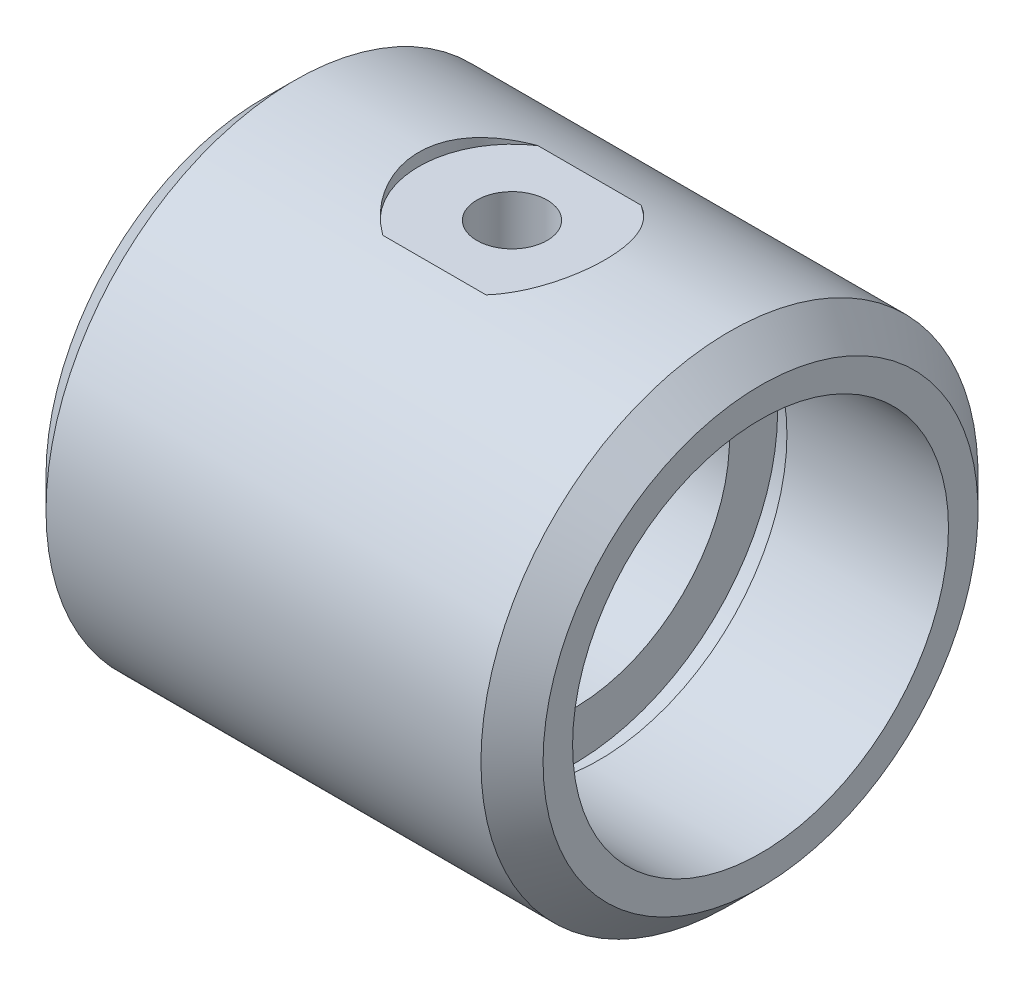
ISO-10303-21;
HEADER;
FILE_DESCRIPTION(('STEP AP214'),'2;1');
FILE_NAME('part.step','',(''),(''),'','','');
FILE_SCHEMA(('AUTOMOTIVE_DESIGN { 1 0 10303 214 1 1 1 1 }'));
ENDSEC;
DATA;
#1=APPLICATION_CONTEXT('core data for automotive mechanical design processes');
#2=APPLICATION_PROTOCOL_DEFINITION('international standard','automotive_design',2000,#1);
#3=PRODUCT_CONTEXT('',#1,'mechanical');
#4=PRODUCT('Part','Part','',(#3));
#5=PRODUCT_RELATED_PRODUCT_CATEGORY('part','',(#4));
#6=PRODUCT_DEFINITION_FORMATION('','',#4);
#7=PRODUCT_DEFINITION_CONTEXT('part definition',#1,'design');
#8=PRODUCT_DEFINITION('design','',#6,#7);
#9=PRODUCT_DEFINITION_SHAPE('','',#8);
#10=(LENGTH_UNIT() NAMED_UNIT(*) SI_UNIT(.MILLI.,.METRE.));
#11=(NAMED_UNIT(*) PLANE_ANGLE_UNIT() SI_UNIT($,.RADIAN.));
#12=(NAMED_UNIT(*) SI_UNIT($,.STERADIAN.) SOLID_ANGLE_UNIT());
#13=UNCERTAINTY_MEASURE_WITH_UNIT(LENGTH_MEASURE(1.E-05),#10,'distance_accuracy_value','');
#14=(GEOMETRIC_REPRESENTATION_CONTEXT(3) GLOBAL_UNCERTAINTY_ASSIGNED_CONTEXT((#13)) GLOBAL_UNIT_ASSIGNED_CONTEXT((#10,
#11,#12)) REPRESENTATION_CONTEXT('',''));
#15=CARTESIAN_POINT('',(0.,0.,0.));
#16=DIRECTION('',(0.,0.,1.));
#17=DIRECTION('',(1.,0.,0.));
#18=AXIS2_PLACEMENT_3D('',#15,#16,#17);
#19=CARTESIAN_POINT('',(0.,8.,0.));
#20=DIRECTION('',(0.,1.,0.));
#21=DIRECTION('',(0.,0.,1.));
#22=AXIS2_PLACEMENT_3D('',#19,#20,#21);
#23=CYLINDRICAL_SURFACE('',#22,1.1303);
#24=CARTESIAN_POINT('',(0.,4.87056689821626,1.1303));
#25=CARTESIAN_POINT('',(0.0626128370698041,4.87056816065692,1.13029792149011));
#26=CARTESIAN_POINT('',(0.125250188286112,4.87178742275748,1.12507965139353));
#27=CARTESIAN_POINT('',(0.248739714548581,4.87652300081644,1.10436958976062));
#28=CARTESIAN_POINT('',(0.309590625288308,4.88004090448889,1.08887069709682));
#29=CARTESIAN_POINT('',(0.427703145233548,4.88895544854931,1.0481155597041));
#30=CARTESIAN_POINT('',(0.484968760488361,4.89434994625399,1.02287043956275));
#31=CARTESIAN_POINT('',(0.594454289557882,4.90640725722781,0.963371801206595));
#32=CARTESIAN_POINT('',(0.646674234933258,4.91307006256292,0.929118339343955));
#33=CARTESIAN_POINT('',(0.745528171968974,4.92704754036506,0.851916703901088));
#34=CARTESIAN_POINT('',(0.79205789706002,4.93437102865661,0.808836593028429));
#35=CARTESIAN_POINT('',(0.87729620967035,4.94876768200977,0.715489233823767));
#36=CARTESIAN_POINT('',(0.916004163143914,4.95584082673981,0.665221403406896));
#37=CARTESIAN_POINT('',(0.984915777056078,4.96903620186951,0.558223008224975));
#38=CARTESIAN_POINT('',(1.01501866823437,4.97514681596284,0.501425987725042));
#39=CARTESIAN_POINT('',(1.065212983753,4.98562882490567,0.38341785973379));
#40=CARTESIAN_POINT('',(1.08530560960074,4.99000042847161,0.322207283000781));
#41=CARTESIAN_POINT('',(1.1145797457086,4.9964495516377,0.198194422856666));
#42=CARTESIAN_POINT('',(1.12393786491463,4.99856416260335,0.135435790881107));
#43=CARTESIAN_POINT('',(1.13203001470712,5.00038971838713,0.00920613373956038));
#44=CARTESIAN_POINT('',(1.13076534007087,5.00010095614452,-0.0542648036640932));
#45=CARTESIAN_POINT('',(1.11777833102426,4.9971804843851,-0.178898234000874));
#46=CARTESIAN_POINT('',(1.10624641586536,4.99459143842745,-0.240081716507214));
#47=CARTESIAN_POINT('',(1.07335629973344,4.98741014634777,-0.359621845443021));
#48=CARTESIAN_POINT('',(1.05199763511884,4.98281780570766,-0.417978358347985));
#49=CARTESIAN_POINT('',(0.999895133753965,4.972078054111,-0.530730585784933));
#50=CARTESIAN_POINT('',(0.969080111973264,4.96591891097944,-0.585092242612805));
#51=CARTESIAN_POINT('',(0.898992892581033,4.95271932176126,-0.687941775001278));
#52=CARTESIAN_POINT('',(0.859719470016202,4.94567874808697,-0.736428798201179));
#53=CARTESIAN_POINT('',(0.772797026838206,4.9313044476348,-0.827286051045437));
#54=CARTESIAN_POINT('',(0.724981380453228,4.92396768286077,-0.869496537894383));
#55=CARTESIAN_POINT('',(0.622873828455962,4.90997360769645,-0.94533091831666));
#56=CARTESIAN_POINT('',(0.568581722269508,4.90331631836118,-0.978954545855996));
#57=CARTESIAN_POINT('',(0.454791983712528,4.89142621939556,-1.03673855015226));
#58=CARTESIAN_POINT('',(0.39527755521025,4.88619824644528,-1.06086691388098));
#59=CARTESIAN_POINT('',(0.272892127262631,4.87782440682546,-1.09873064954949));
#60=CARTESIAN_POINT('',(0.210021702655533,4.87467818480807,-1.11246779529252));
#61=CARTESIAN_POINT('',(0.084173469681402,4.87089704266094,-1.12890756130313));
#62=CARTESIAN_POINT('',(0.0212277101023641,4.87020901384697,-1.13184357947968));
#63=CARTESIAN_POINT('',(-0.104253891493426,4.87127860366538,-1.12723123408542));
#64=CARTESIAN_POINT('',(-0.166789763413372,4.87303604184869,-1.11968364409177));
#65=CARTESIAN_POINT('',(-0.288851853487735,4.87874822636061,-1.09452133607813));
#66=CARTESIAN_POINT('',(-0.348406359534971,4.88267454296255,-1.07703678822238));
#67=CARTESIAN_POINT('',(-0.463740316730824,4.8922561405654,-1.03263857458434));
#68=CARTESIAN_POINT('',(-0.519519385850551,4.89791159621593,-1.00572395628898));
#69=CARTESIAN_POINT('',(-0.626724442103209,4.9104298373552,-0.942721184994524));
#70=CARTESIAN_POINT('',(-0.678064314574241,4.91731085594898,-0.906490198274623));
#71=CARTESIAN_POINT('',(-0.774021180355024,4.93145759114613,-0.826068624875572));
#72=CARTESIAN_POINT('',(-0.81863727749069,4.93872335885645,-0.781876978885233));
#73=CARTESIAN_POINT('',(-0.900794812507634,4.95299709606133,-0.685728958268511));
#74=CARTESIAN_POINT('',(-0.938176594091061,4.95999698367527,-0.633634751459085));
#75=CARTESIAN_POINT('',(-1.00365871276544,4.97279778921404,-0.523770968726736));
#76=CARTESIAN_POINT('',(-1.03175949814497,4.97859876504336,-0.466001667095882));
#77=CARTESIAN_POINT('',(-1.0776639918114,4.98831425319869,-0.34679910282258));
#78=CARTESIAN_POINT('',(-1.09553533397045,4.99224112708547,-0.285392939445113));
#79=CARTESIAN_POINT('',(-1.12068331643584,4.99781957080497,-0.16035054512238));
#80=CARTESIAN_POINT('',(-1.12796160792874,4.99947149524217,-0.0967146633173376));
#81=CARTESIAN_POINT('',(-1.13163842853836,5.00030249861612,0.0294688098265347));
#82=CARTESIAN_POINT('',(-1.12827468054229,4.99953561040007,0.0920092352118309));
#83=CARTESIAN_POINT('',(-1.11129748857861,4.99573182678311,0.215608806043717));
#84=CARTESIAN_POINT('',(-1.09768425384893,4.99269497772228,0.276667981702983));
#85=CARTESIAN_POINT('',(-1.06071166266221,4.98469749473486,0.395373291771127));
#86=CARTESIAN_POINT('',(-1.03738812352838,4.97974393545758,0.453031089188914));
#87=CARTESIAN_POINT('',(-0.981691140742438,4.96844025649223,0.563645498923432));
#88=CARTESIAN_POINT('',(-0.949316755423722,4.962089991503,0.616601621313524));
#89=CARTESIAN_POINT('',(-0.87567309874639,4.94852427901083,0.717462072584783));
#90=CARTESIAN_POINT('',(-0.834237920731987,4.94129399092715,0.765243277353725));
#91=CARTESIAN_POINT('',(-0.743980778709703,4.92685993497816,0.853255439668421));
#92=CARTESIAN_POINT('',(-0.695157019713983,4.9196561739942,0.893484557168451));
#93=CARTESIAN_POINT('',(-0.590656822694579,4.90597380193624,0.965815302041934));
#94=CARTESIAN_POINT('',(-0.534891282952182,4.89950722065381,0.997790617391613));
#95=CARTESIAN_POINT('',(-0.418642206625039,4.88818473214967,1.05186453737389));
#96=CARTESIAN_POINT('',(-0.358162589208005,4.8833275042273,1.07397124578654));
#97=CARTESIAN_POINT('',(-0.248046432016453,4.87664133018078,1.10387748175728));
#98=CARTESIAN_POINT('',(-0.198992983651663,4.87437897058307,1.11376636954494));
#99=CARTESIAN_POINT('',(-0.0999648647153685,4.87134129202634,1.12697827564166));
#100=CARTESIAN_POINT('',(-0.0499902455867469,4.87056589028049,1.13030165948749));
#101=CARTESIAN_POINT('',(0.,4.87056689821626,1.1303));
#102=B_SPLINE_CURVE_WITH_KNOTS('',3,(#24,#25,#26,#27,#28,#29,#30,#31,#32,#33,#34,#35,#36,#37,
#38,#39,#40,#41,#42,#43,#44,#45,#46,#47,#48,#49,#50,#51,#52,#53,#54,#55,#56,#57,#58,#59,#60,#61,
#62,#63,#64,#65,#66,#67,#68,#69,#70,#71,#72,#73,#74,#75,#76,#77,#78,#79,#80,#81,#82,#83,#84,#85,
#86,#87,#88,#89,#90,#91,#92,#93,#94,#95,#96,#97,#98,#99,#100,#101),.UNSPECIFIED.,.T.,.F.,(4,2,2,
2,2,2,2,2,2,2,2,2,2,2,2,2,2,2,2,2,2,2,2,2,2,2,2,2,2,2,2,2,2,2,2,2,2,2,4),(0.,0.187655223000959,
0.375440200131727,0.563011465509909,0.750581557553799,0.941192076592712,1.13181804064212,
1.32459255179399,1.51734391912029,1.70687639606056,1.89638577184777,2.08245201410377,
2.26852703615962,2.45603864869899,2.64357743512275,2.8352807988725,3.02699010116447,
3.21934031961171,3.41165769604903,3.59979409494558,3.78791661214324,3.97362979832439,
4.15936174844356,4.34813134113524,4.53692607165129,4.72950344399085,4.92207151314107,
5.11335122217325,5.30460111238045,5.49160925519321,5.67861358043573,5.86493415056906,
6.05127411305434,6.24136439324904,6.43150092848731,6.62439455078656,6.8171294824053,
6.9669622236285,7.11678662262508),.UNSPECIFIED.);
#103=CARTESIAN_POINT('',(0.,4.87056689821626,1.1303));
#104=VERTEX_POINT('',#103);
#105=EDGE_CURVE('E109',#104,#104,#102,.T.);
#106=ORIENTED_EDGE('',*,*,#105,.F.);
#107=EDGE_LOOP('',(#106));
#108=FACE_BOUND('',#107,.T.);
#109=CARTESIAN_POINT('',(0.,7.6,0.));
#110=DIRECTION('',(0.,1.,0.));
#111=DIRECTION('',(0.,0.,1.));
#112=AXIS2_PLACEMENT_3D('',#109,#110,#111);
#113=CIRCLE('',#112,1.1303);
#114=CARTESIAN_POINT('',(0.,7.6,1.1303));
#115=VERTEX_POINT('',#114);
#116=EDGE_CURVE('E91',#115,#115,#113,.F.);
#117=ORIENTED_EDGE('',*,*,#116,.F.);
#118=EDGE_LOOP('',(#117));
#119=FACE_BOUND('',#118,.T.);
#120=ADVANCED_FACE('F48',(#108,#119),#23,.F.);
#121=CARTESIAN_POINT('',(-15.8113842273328,0.,0.));
#122=DIRECTION('',(-1.,0.,0.));
#123=DIRECTION('',(0.,0.,1.));
#124=AXIS2_PLACEMENT_3D('',#121,#122,#123);
#125=CYLINDRICAL_SURFACE('',#124,6.05);
#126=CARTESIAN_POINT('',(-2.8,0.,0.));
#127=DIRECTION('',(-1.,0.,0.));
#128=DIRECTION('',(0.,0.,1.));
#129=AXIS2_PLACEMENT_3D('',#126,#127,#128);
#130=CIRCLE('',#129,6.05);
#131=CARTESIAN_POINT('',(-2.8,0.,6.05));
#132=VERTEX_POINT('',#131);
#133=EDGE_CURVE('E145',#132,#132,#130,.T.);
#134=ORIENTED_EDGE('',*,*,#133,.F.);
#135=EDGE_LOOP('',(#134));
#136=FACE_BOUND('',#135,.T.);
#137=CARTESIAN_POINT('',(-8.,0.,0.));
#138=DIRECTION('',(-1.,0.,0.));
#139=DIRECTION('',(0.,0.,1.));
#140=AXIS2_PLACEMENT_3D('',#137,#138,#139);
#141=CIRCLE('',#140,6.05);
#142=CARTESIAN_POINT('',(-8.,0.,6.05));
#143=VERTEX_POINT('',#142);
#144=EDGE_CURVE('E199',#143,#143,#141,.T.);
#145=ORIENTED_EDGE('',*,*,#144,.T.);
#146=EDGE_LOOP('',(#145));
#147=FACE_BOUND('',#146,.T.);
#148=ADVANCED_FACE('F50',(#136,#147),#125,.F.);
#149=CARTESIAN_POINT('',(-8.,0.,-6.05));
#150=DIRECTION('',(1.,0.,0.));
#151=DIRECTION('',(0.,0.,-1.));
#152=AXIS2_PLACEMENT_3D('',#149,#150,#151);
#153=PLANE('',#152);
#154=ORIENTED_EDGE('',*,*,#144,.F.);
#155=EDGE_LOOP('',(#154));
#156=FACE_BOUND('',#155,.T.);
#157=CARTESIAN_POINT('',(-8.,0.,0.));
#158=DIRECTION('',(-1.,0.,0.));
#159=DIRECTION('',(0.,0.,1.));
#160=AXIS2_PLACEMENT_3D('',#157,#158,#159);
#161=CIRCLE('',#160,7.);
#162=CARTESIAN_POINT('',(-8.,0.,7.));
#163=VERTEX_POINT('',#162);
#164=EDGE_CURVE('E196',#163,#163,#161,.T.);
#165=ORIENTED_EDGE('',*,*,#164,.T.);
#166=EDGE_LOOP('',(#165));
#167=FACE_BOUND('',#166,.T.);
#168=ADVANCED_FACE('F214',(#156,#167),#153,.F.);
#169=CARTESIAN_POINT('',(-7.,0.,0.));
#170=DIRECTION('',(1.,0.,0.));
#171=DIRECTION('',(0.,0.,-1.));
#172=AXIS2_PLACEMENT_3D('',#169,#170,#171);
#173=CONICAL_SURFACE('',#172,8.,0.785398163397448);
#174=ORIENTED_EDGE('',*,*,#164,.F.);
#175=EDGE_LOOP('',(#174));
#176=FACE_BOUND('',#175,.T.);
#177=CARTESIAN_POINT('',(-7.,0.,0.));
#178=DIRECTION('',(-1.,0.,0.));
#179=DIRECTION('',(0.,0.,1.));
#180=AXIS2_PLACEMENT_3D('',#177,#178,#179);
#181=CIRCLE('',#180,8.);
#182=CARTESIAN_POINT('',(-7.,0.,8.));
#183=VERTEX_POINT('',#182);
#184=EDGE_CURVE('E192',#183,#183,#181,.T.);
#185=ORIENTED_EDGE('',*,*,#184,.T.);
#186=EDGE_LOOP('',(#185));
#187=FACE_BOUND('',#186,.T.);
#188=ADVANCED_FACE('F210',(#176,#187),#173,.T.);
#189=CARTESIAN_POINT('',(-15.8113842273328,0.,0.));
#190=DIRECTION('',(-1.,0.,0.));
#191=DIRECTION('',(0.,0.,1.));
#192=AXIS2_PLACEMENT_3D('',#189,#190,#191);
#193=CYLINDRICAL_SURFACE('',#192,8.);
#194=CARTESIAN_POINT('',(1.66132477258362,7.6,-2.49799919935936));
#195=CARTESIAN_POINT('',(1.73239124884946,7.61553471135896,-2.45073033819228));
#196=CARTESIAN_POINT('',(1.80133165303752,7.63155418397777,-2.40050954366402));
#197=CARTESIAN_POINT('',(1.93461735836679,7.6641090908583,-2.29445424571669));
#198=CARTESIAN_POINT('',(1.99896278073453,7.68064451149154,-2.23861989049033));
#199=CARTESIAN_POINT('',(2.18466972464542,7.73036497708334,-2.06305955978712));
#200=CARTESIAN_POINT('',(2.29861833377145,7.76364507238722,-1.93533205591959));
#201=CARTESIAN_POINT('',(2.50355484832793,7.82676439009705,-1.66176855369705));
#202=CARTESIAN_POINT('',(2.59452385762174,7.85660076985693,-1.51591779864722));
#203=CARTESIAN_POINT('',(2.75054990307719,7.90949619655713,-1.20991906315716));
#204=CARTESIAN_POINT('',(2.81563173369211,7.93256172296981,-1.04978494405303));
#205=CARTESIAN_POINT('',(2.91602593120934,7.96875577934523,-0.724510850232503));
#206=CARTESIAN_POINT('',(2.95214909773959,7.98215381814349,-0.559651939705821));
#207=CARTESIAN_POINT('',(2.9962338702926,7.99856143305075,-0.225676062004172));
#208=CARTESIAN_POINT('',(3.00419823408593,8.00157202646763,-0.0565595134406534));
#209=CARTESIAN_POINT('',(2.99196600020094,7.9969898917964,0.27125949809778));
#210=CARTESIAN_POINT('',(2.97327503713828,7.98996403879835,0.430028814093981));
#211=CARTESIAN_POINT('',(2.91115263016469,7.96705601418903,0.741940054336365));
#212=CARTESIAN_POINT('',(2.86772501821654,7.95117521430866,0.895082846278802));
#213=CARTESIAN_POINT('',(2.75742506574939,7.9120625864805,1.19242455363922));
#214=CARTESIAN_POINT('',(2.69044835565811,7.88879807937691,1.33658023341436));
#215=CARTESIAN_POINT('',(2.53509522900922,7.83717743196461,1.61192689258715));
#216=CARTESIAN_POINT('',(2.44670617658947,7.80881828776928,1.74311015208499));
#217=CARTESIAN_POINT('',(2.25144536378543,7.74986505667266,1.98882947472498));
#218=CARTESIAN_POINT('',(2.14470099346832,7.71928716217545,2.10347087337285));
#219=CARTESIAN_POINT('',(1.91476906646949,7.65859621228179,2.31475305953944));
#220=CARTESIAN_POINT('',(1.79159762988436,7.62848273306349,2.41141127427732));
#221=CARTESIAN_POINT('',(1.66132477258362,7.6,2.49799919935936));
#222=B_SPLINE_CURVE_WITH_KNOTS('',3,(#194,#195,#196,#197,#198,#199,#200,#201,#202,#203,#204,
#205,#206,#207,#208,#209,#210,#211,#212,#213,#214,#215,#216,#217,#218,#219,#220,#221),
.UNSPECIFIED.,.F.,.F.,(4,2,2,2,2,2,2,2,2,2,2,2,2,4),(0.,0.260092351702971,0.5201778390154,
1.04065181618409,1.56155239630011,2.08195285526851,2.58721726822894,3.09243219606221,
3.57021437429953,4.04792255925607,4.52777520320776,5.00791171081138,5.48484135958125,
5.9613063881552),.UNSPECIFIED.);
#223=CARTESIAN_POINT('',(1.66132477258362,7.6,-2.49799919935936));
#224=VERTEX_POINT('',#223);
#225=CARTESIAN_POINT('',(1.66132477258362,7.6,2.49799919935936));
#226=VERTEX_POINT('',#225);
#227=EDGE_CURVE('E13',#224,#226,#222,.T.);
#228=ORIENTED_EDGE('',*,*,#227,.T.);
#229=DIRECTION('',(-1.,0.,0.));
#230=VECTOR('',#229,1.);
#231=CARTESIAN_POINT('',(-15.8113842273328,7.6,2.49799919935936));
#232=LINE('',#231,#230);
#233=CARTESIAN_POINT('',(-1.66132477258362,7.6,2.49799919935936));
#234=VERTEX_POINT('',#233);
#235=EDGE_CURVE('E84',#234,#226,#232,.F.);
#236=ORIENTED_EDGE('',*,*,#235,.F.);
#237=CARTESIAN_POINT('',(-1.66132477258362,7.6,2.49799919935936));
#238=CARTESIAN_POINT('',(-1.73239124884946,7.61553471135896,2.45073033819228));
#239=CARTESIAN_POINT('',(-1.80133165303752,7.63155418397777,2.40050954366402));
#240=CARTESIAN_POINT('',(-1.93461735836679,7.6641090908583,2.29445424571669));
#241=CARTESIAN_POINT('',(-1.99896278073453,7.68064451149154,2.23861989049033));
#242=CARTESIAN_POINT('',(-2.18466972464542,7.73036497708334,2.06305955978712));
#243=CARTESIAN_POINT('',(-2.29861833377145,7.76364507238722,1.93533205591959));
#244=CARTESIAN_POINT('',(-2.50355484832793,7.82676439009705,1.66176855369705));
#245=CARTESIAN_POINT('',(-2.59452385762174,7.85660076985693,1.51591779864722));
#246=CARTESIAN_POINT('',(-2.75054990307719,7.90949619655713,1.20991906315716));
#247=CARTESIAN_POINT('',(-2.81563173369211,7.93256172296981,1.04978494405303));
#248=CARTESIAN_POINT('',(-2.91602593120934,7.96875577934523,0.724510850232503));
#249=CARTESIAN_POINT('',(-2.95214909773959,7.98215381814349,0.559651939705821));
#250=CARTESIAN_POINT('',(-2.9962338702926,7.99856143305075,0.225676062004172));
#251=CARTESIAN_POINT('',(-3.00419823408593,8.00157202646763,0.0565595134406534));
#252=CARTESIAN_POINT('',(-2.99196600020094,7.9969898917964,-0.27125949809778));
#253=CARTESIAN_POINT('',(-2.97327503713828,7.98996403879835,-0.430028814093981));
#254=CARTESIAN_POINT('',(-2.91115263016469,7.96705601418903,-0.741940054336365));
#255=CARTESIAN_POINT('',(-2.86772501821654,7.95117521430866,-0.895082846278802));
#256=CARTESIAN_POINT('',(-2.75742506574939,7.9120625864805,-1.19242455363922));
#257=CARTESIAN_POINT('',(-2.69044835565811,7.88879807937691,-1.33658023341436));
#258=CARTESIAN_POINT('',(-2.53509522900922,7.83717743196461,-1.61192689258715));
#259=CARTESIAN_POINT('',(-2.44670617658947,7.80881828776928,-1.74311015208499));
#260=CARTESIAN_POINT('',(-2.25144536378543,7.74986505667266,-1.98882947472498));
#261=CARTESIAN_POINT('',(-2.14470099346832,7.71928716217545,-2.10347087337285));
#262=CARTESIAN_POINT('',(-1.91476906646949,7.65859621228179,-2.31475305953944));
#263=CARTESIAN_POINT('',(-1.79159762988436,7.62848273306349,-2.41141127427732));
#264=CARTESIAN_POINT('',(-1.66132477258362,7.6,-2.49799919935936));
#265=B_SPLINE_CURVE_WITH_KNOTS('',3,(#237,#238,#239,#240,#241,#242,#243,#244,#245,#246,#247,
#248,#249,#250,#251,#252,#253,#254,#255,#256,#257,#258,#259,#260,#261,#262,#263,#264),
.UNSPECIFIED.,.F.,.F.,(4,2,2,2,2,2,2,2,2,2,2,2,2,4),(0.,0.260092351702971,0.5201778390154,
1.04065181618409,1.56155239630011,2.08195285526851,2.58721726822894,3.09243219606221,
3.57021437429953,4.04792255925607,4.52777520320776,5.00791171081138,5.48484135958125,
5.9613063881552),.UNSPECIFIED.);
#266=CARTESIAN_POINT('',(-1.66132477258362,7.6,-2.49799919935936));
#267=VERTEX_POINT('',#266);
#268=EDGE_CURVE('E62',#234,#267,#265,.T.);
#269=ORIENTED_EDGE('',*,*,#268,.T.);
#270=DIRECTION('',(-1.,0.,0.));
#271=VECTOR('',#270,1.);
#272=CARTESIAN_POINT('',(-15.8113842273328,7.6,-2.49799919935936));
#273=LINE('',#272,#271);
#274=EDGE_CURVE('E74',#224,#267,#273,.T.);
#275=ORIENTED_EDGE('',*,*,#274,.F.);
#276=EDGE_LOOP('',(#228,#236,#269,#275));
#277=FACE_BOUND('',#276,.T.);
#278=ORIENTED_EDGE('',*,*,#184,.F.);
#279=EDGE_LOOP('',(#278));
#280=FACE_BOUND('',#279,.T.);
#281=CARTESIAN_POINT('',(7.,0.,0.));
#282=DIRECTION('',(-1.,0.,0.));
#283=DIRECTION('',(0.,0.,1.));
#284=AXIS2_PLACEMENT_3D('',#281,#282,#283);
#285=CIRCLE('',#284,8.);
#286=CARTESIAN_POINT('',(7.,0.,8.));
#287=VERTEX_POINT('',#286);
#288=EDGE_CURVE('E185',#287,#287,#285,.T.);
#289=ORIENTED_EDGE('',*,*,#288,.T.);
#290=EDGE_LOOP('',(#289));
#291=FACE_BOUND('',#290,.T.);
#292=ADVANCED_FACE('F82',(#277,#280,#291),#193,.T.);
#293=CARTESIAN_POINT('',(8.,0.,0.));
#294=DIRECTION('',(-1.,0.,0.));
#295=DIRECTION('',(0.,0.,1.));
#296=AXIS2_PLACEMENT_3D('',#293,#294,#295);
#297=CONICAL_SURFACE('',#296,7.,0.785398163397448);
#298=ORIENTED_EDGE('',*,*,#288,.F.);
#299=EDGE_LOOP('',(#298));
#300=FACE_BOUND('',#299,.T.);
#301=CARTESIAN_POINT('',(8.,0.,0.));
#302=DIRECTION('',(-1.,0.,0.));
#303=DIRECTION('',(0.,0.,1.));
#304=AXIS2_PLACEMENT_3D('',#301,#302,#303);
#305=CIRCLE('',#304,7.);
#306=CARTESIAN_POINT('',(8.,0.,7.));
#307=VERTEX_POINT('',#306);
#308=EDGE_CURVE('E180',#307,#307,#305,.T.);
#309=ORIENTED_EDGE('',*,*,#308,.T.);
#310=EDGE_LOOP('',(#309));
#311=FACE_BOUND('',#310,.T.);
#312=ADVANCED_FACE('F209',(#300,#311),#297,.T.);
#313=CARTESIAN_POINT('',(8.,0.,-7.));
#314=DIRECTION('',(-1.,0.,0.));
#315=DIRECTION('',(0.,0.,1.));
#316=AXIS2_PLACEMENT_3D('',#313,#314,#315);
#317=PLANE('',#316);
#318=ORIENTED_EDGE('',*,*,#308,.F.);
#319=EDGE_LOOP('',(#318));
#320=FACE_BOUND('',#319,.T.);
#321=CARTESIAN_POINT('',(8.,0.,0.));
#322=DIRECTION('',(-1.,0.,0.));
#323=DIRECTION('',(0.,0.,1.));
#324=AXIS2_PLACEMENT_3D('',#321,#322,#323);
#325=CIRCLE('',#324,6.05);
#326=CARTESIAN_POINT('',(8.,0.,6.05));
#327=VERTEX_POINT('',#326);
#328=EDGE_CURVE('E177',#327,#327,#325,.T.);
#329=ORIENTED_EDGE('',*,*,#328,.T.);
#330=EDGE_LOOP('',(#329));
#331=FACE_BOUND('',#330,.T.);
#332=ADVANCED_FACE('F173',(#320,#331),#317,.F.);
#333=CARTESIAN_POINT('',(-15.8113842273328,0.,0.));
#334=DIRECTION('',(-1.,0.,0.));
#335=DIRECTION('',(0.,0.,1.));
#336=AXIS2_PLACEMENT_3D('',#333,#334,#335);
#337=CYLINDRICAL_SURFACE('',#336,6.05);
#338=CARTESIAN_POINT('',(2.8,0.,0.));
#339=DIRECTION('',(1.,0.,0.));
#340=DIRECTION('',(0.,0.,-1.));
#341=AXIS2_PLACEMENT_3D('',#338,#339,#340);
#342=CIRCLE('',#341,6.05);
#343=CARTESIAN_POINT('',(2.8,0.,-6.05));
#344=VERTEX_POINT('',#343);
#345=EDGE_CURVE('E160',#344,#344,#342,.T.);
#346=ORIENTED_EDGE('',*,*,#345,.F.);
#347=EDGE_LOOP('',(#346));
#348=FACE_BOUND('',#347,.T.);
#349=ORIENTED_EDGE('',*,*,#328,.F.);
#350=EDGE_LOOP('',(#349));
#351=FACE_BOUND('',#350,.T.);
#352=ADVANCED_FACE('F170',(#348,#351),#337,.F.);
#353=CARTESIAN_POINT('',(2.,0.,-5.));
#354=DIRECTION('',(-1.,0.,0.));
#355=DIRECTION('',(0.,0.,1.));
#356=AXIS2_PLACEMENT_3D('',#353,#354,#355);
#357=PLANE('',#356);
#358=CARTESIAN_POINT('',(2.,0.,0.));
#359=DIRECTION('',(-1.,0.,0.));
#360=DIRECTION('',(0.,0.,1.));
#361=AXIS2_PLACEMENT_3D('',#358,#359,#360);
#362=CIRCLE('',#361,5.);
#363=CARTESIAN_POINT('',(2.,0.,5.));
#364=VERTEX_POINT('',#363);
#365=EDGE_CURVE('E181',#364,#364,#362,.T.);
#366=ORIENTED_EDGE('',*,*,#365,.T.);
#367=EDGE_LOOP('',(#366));
#368=FACE_BOUND('',#367,.T.);
#369=CARTESIAN_POINT('',(2.,0.,0.));
#370=DIRECTION('',(1.,0.,0.));
#371=DIRECTION('',(0.,0.,-1.));
#372=AXIS2_PLACEMENT_3D('',#369,#370,#371);
#373=CIRCLE('',#372,6.55);
#374=CARTESIAN_POINT('',(2.,0.,-6.55));
#375=VERTEX_POINT('',#374);
#376=EDGE_CURVE('E156',#375,#375,#373,.T.);
#377=ORIENTED_EDGE('',*,*,#376,.T.);
#378=EDGE_LOOP('',(#377));
#379=FACE_BOUND('',#378,.T.);
#380=ADVANCED_FACE('F136',(#368,#379),#357,.F.);
#381=CARTESIAN_POINT('',(-15.8113842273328,0.,0.));
#382=DIRECTION('',(-1.,0.,0.));
#383=DIRECTION('',(0.,0.,1.));
#384=AXIS2_PLACEMENT_3D('',#381,#382,#383);
#385=CYLINDRICAL_SURFACE('',#384,5.);
#386=ORIENTED_EDGE('',*,*,#105,.T.);
#387=EDGE_LOOP('',(#386));
#388=FACE_BOUND('',#387,.T.);
#389=ORIENTED_EDGE('',*,*,#365,.F.);
#390=EDGE_LOOP('',(#389));
#391=FACE_BOUND('',#390,.T.);
#392=CARTESIAN_POINT('',(-2.,0.,0.));
#393=DIRECTION('',(-1.,0.,0.));
#394=DIRECTION('',(0.,0.,1.));
#395=AXIS2_PLACEMENT_3D('',#392,#393,#394);
#396=CIRCLE('',#395,5.);
#397=CARTESIAN_POINT('',(-2.,0.,5.));
#398=VERTEX_POINT('',#397);
#399=EDGE_CURVE('E117',#398,#398,#396,.T.);
#400=ORIENTED_EDGE('',*,*,#399,.T.);
#401=EDGE_LOOP('',(#400));
#402=FACE_BOUND('',#401,.T.);
#403=ADVANCED_FACE('F119',(#388,#391,#402),#385,.F.);
#404=CARTESIAN_POINT('',(-2.,0.,-6.05));
#405=DIRECTION('',(1.,0.,0.));
#406=DIRECTION('',(0.,0.,-1.));
#407=AXIS2_PLACEMENT_3D('',#404,#405,#406);
#408=PLANE('',#407);
#409=ORIENTED_EDGE('',*,*,#399,.F.);
#410=EDGE_LOOP('',(#409));
#411=FACE_BOUND('',#410,.T.);
#412=CARTESIAN_POINT('',(-2.,0.,0.));
#413=DIRECTION('',(-1.,0.,0.));
#414=DIRECTION('',(0.,0.,1.));
#415=AXIS2_PLACEMENT_3D('',#412,#413,#414);
#416=CIRCLE('',#415,6.55);
#417=CARTESIAN_POINT('',(-2.,0.,6.55));
#418=VERTEX_POINT('',#417);
#419=EDGE_CURVE('E104',#418,#418,#416,.T.);
#420=ORIENTED_EDGE('',*,*,#419,.T.);
#421=EDGE_LOOP('',(#420));
#422=FACE_BOUND('',#421,.T.);
#423=ADVANCED_FACE('F128',(#411,#422),#408,.F.);
#424=CARTESIAN_POINT('',(0.,7.6,0.));
#425=DIRECTION('',(0.,1.,0.));
#426=DIRECTION('',(0.,0.,1.));
#427=AXIS2_PLACEMENT_3D('',#424,#425,#426);
#428=CYLINDRICAL_SURFACE('',#427,3.);
#429=CARTESIAN_POINT('',(0.,7.6,0.));
#430=DIRECTION('',(0.,1.,0.));
#431=DIRECTION('',(0.,0.,1.));
#432=AXIS2_PLACEMENT_3D('',#429,#430,#431);
#433=CIRCLE('',#432,3.);
#434=EDGE_CURVE('E88',#226,#224,#433,.T.);
#435=ORIENTED_EDGE('',*,*,#434,.F.);
#436=ORIENTED_EDGE('',*,*,#227,.F.);
#437=EDGE_LOOP('',(#435,#436));
#438=FACE_BOUND('',#437,.T.);
#439=ADVANCED_FACE('F93',(#438),#428,.F.);
#440=EDGE_CURVE('E89',#267,#234,#433,.T.);
#441=ORIENTED_EDGE('',*,*,#440,.F.);
#442=ORIENTED_EDGE('',*,*,#268,.F.);
#443=EDGE_LOOP('',(#441,#442));
#444=FACE_BOUND('',#443,.T.);
#445=ADVANCED_FACE('F135',(#444),#428,.F.);
#446=CARTESIAN_POINT('',(0.,7.6,0.));
#447=DIRECTION('',(0.,1.,0.));
#448=DIRECTION('',(0.,0.,1.));
#449=AXIS2_PLACEMENT_3D('',#446,#447,#448);
#450=PLANE('',#449);
#451=ORIENTED_EDGE('',*,*,#116,.T.);
#452=EDGE_LOOP('',(#451));
#453=FACE_BOUND('',#452,.T.);
#454=ORIENTED_EDGE('',*,*,#274,.T.);
#455=ORIENTED_EDGE('',*,*,#440,.T.);
#456=ORIENTED_EDGE('',*,*,#235,.T.);
#457=ORIENTED_EDGE('',*,*,#434,.T.);
#458=EDGE_LOOP('',(#454,#455,#456,#457));
#459=FACE_BOUND('',#458,.T.);
#460=ADVANCED_FACE('F87',(#453,#459),#450,.T.);
#461=CARTESIAN_POINT('',(-2.8,0.,0.));
#462=DIRECTION('',(-1.,0.,0.));
#463=DIRECTION('',(0.,0.,1.));
#464=AXIS2_PLACEMENT_3D('',#461,#462,#463);
#465=PLANE('',#464);
#466=CARTESIAN_POINT('',(-2.8,0.,0.));
#467=DIRECTION('',(-1.,0.,0.));
#468=DIRECTION('',(0.,0.,1.));
#469=AXIS2_PLACEMENT_3D('',#466,#467,#468);
#470=CIRCLE('',#469,6.55);
#471=CARTESIAN_POINT('',(-2.8,0.,6.55));
#472=VERTEX_POINT('',#471);
#473=EDGE_CURVE('E102',#472,#472,#470,.T.);
#474=ORIENTED_EDGE('',*,*,#473,.F.);
#475=EDGE_LOOP('',(#474));
#476=FACE_BOUND('',#475,.T.);
#477=ORIENTED_EDGE('',*,*,#133,.T.);
#478=EDGE_LOOP('',(#477));
#479=FACE_BOUND('',#478,.T.);
#480=ADVANCED_FACE('F256',(#476,#479),#465,.F.);
#481=CARTESIAN_POINT('',(-2.8,0.,0.));
#482=DIRECTION('',(1.,0.,0.));
#483=DIRECTION('',(0.,0.,-1.));
#484=AXIS2_PLACEMENT_3D('',#481,#482,#483);
#485=CYLINDRICAL_SURFACE('',#484,6.55);
#486=ORIENTED_EDGE('',*,*,#473,.T.);
#487=EDGE_LOOP('',(#486));
#488=FACE_BOUND('',#487,.T.);
#489=ORIENTED_EDGE('',*,*,#419,.F.);
#490=EDGE_LOOP('',(#489));
#491=FACE_BOUND('',#490,.T.);
#492=ADVANCED_FACE('F252',(#488,#491),#485,.F.);
#493=CARTESIAN_POINT('',(2.8,0.,0.));
#494=DIRECTION('',(1.,0.,0.));
#495=DIRECTION('',(0.,0.,-1.));
#496=AXIS2_PLACEMENT_3D('',#493,#494,#495);
#497=PLANE('',#496);
#498=CARTESIAN_POINT('',(2.8,0.,0.));
#499=DIRECTION('',(1.,0.,0.));
#500=DIRECTION('',(0.,0.,-1.));
#501=AXIS2_PLACEMENT_3D('',#498,#499,#500);
#502=CIRCLE('',#501,6.55);
#503=CARTESIAN_POINT('',(2.8,0.,-6.55));
#504=VERTEX_POINT('',#503);
#505=EDGE_CURVE('E150',#504,#504,#502,.T.);
#506=ORIENTED_EDGE('',*,*,#505,.F.);
#507=EDGE_LOOP('',(#506));
#508=FACE_BOUND('',#507,.T.);
#509=ORIENTED_EDGE('',*,*,#345,.T.);
#510=EDGE_LOOP('',(#509));
#511=FACE_BOUND('',#510,.T.);
#512=ADVANCED_FACE('F168',(#508,#511),#497,.F.);
#513=CARTESIAN_POINT('',(2.8,0.,0.));
#514=DIRECTION('',(-1.,0.,0.));
#515=DIRECTION('',(0.,0.,1.));
#516=AXIS2_PLACEMENT_3D('',#513,#514,#515);
#517=CYLINDRICAL_SURFACE('',#516,6.55);
#518=ORIENTED_EDGE('',*,*,#505,.T.);
#519=EDGE_LOOP('',(#518));
#520=FACE_BOUND('',#519,.T.);
#521=ORIENTED_EDGE('',*,*,#376,.F.);
#522=EDGE_LOOP('',(#521));
#523=FACE_BOUND('',#522,.T.);
#524=ADVANCED_FACE('F245',(#520,#523),#517,.F.);
#525=CLOSED_SHELL('',(#120,#148,#168,#188,#292,#312,#332,#352,#380,#403,#423,#439,#445,#460,
#480,#492,#512,#524));
#526=MANIFOLD_SOLID_BREP('B2',#525);
#527=ADVANCED_BREP_SHAPE_REPRESENTATION('',(#18,#526),#14);
#528=SHAPE_DEFINITION_REPRESENTATION(#9,#527);
ENDSEC;
END-ISO-10303-21;
